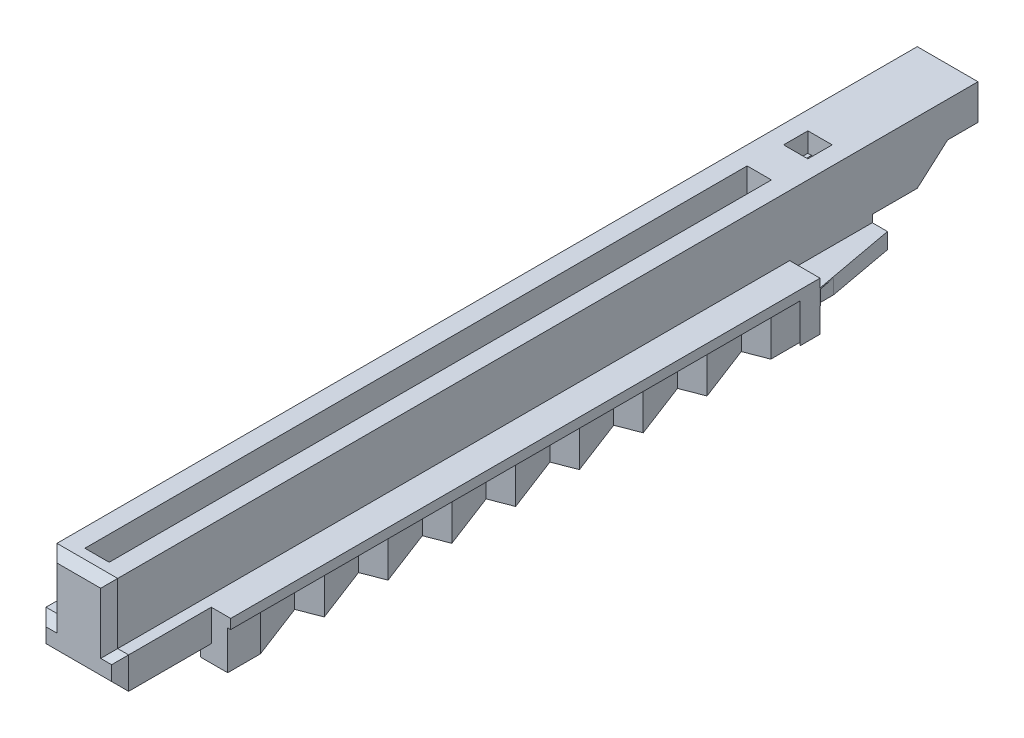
from build123d import *

# Parameters (mm, degrees)
ESQUISSE1_W              = 5
ESQUISSE1_H              = 7.6
BASE_EXTRUSION_DEPTH     = 71.5
ESQUISSE2_W              = 2
ESQUISSE2_H              = 54.5
ENL_V_MAT_EXTRU_1_DEPTH  = 4
ENL_V_MAT_EXTRU_2_DEPTH  = 73.07641778
ENL_V_MAT_EXTRU_3_DEPTH  = 6
ESQUISSE8_W              = 10
ESQUISSE8_H              = 4
BOSS_EXTRU_1_DEPTH       = 56
ESQUISSE9_W              = 5
ESQUISSE9_H              = 56
ENL_V_MAT_EXTRU_7_DEPTH  = 1.4
ENL_V_MAT_EXTRU_8_DEPTH  = 2
ESQUISSE12_W             = 1.6
ESQUISSE12_H             = 7.5
ENL_V_MAT_EXTRU_10_DEPTH = 73.453433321
ESQUISSE13_W             = 1.6
ESQUISSE13_H             = 7.3
ENL_V_MAT_EXTRU_11_DEPTH = 73.453433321
ESQUISSE14_W             = 0.9
ESQUISSE14_H             = 5
ENL_V_MAT_EXTRU_12_DEPTH = 1.4
ESQUISSE15_W             = 0.9
ESQUISSE15_H             = 7.5
ENL_V_MAT_EXTRU_13_DEPTH = 1.4
CHANFREIN1_SIZE          = 0.7
ESQUISSE16_W             = 2.5
ESQUISSE16_H             = 1.3
BOSS_EXTRU_2_DEPTH       = 6.8
ESQUISSE17_W             = 2.5
ESQUISSE17_H             = 1.3
BOSS_EXTRU_3_DEPTH       = 6.8
ENL_V_MAT_EXTRU_14_DEPTH = 73.117889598
ENL_V_MAT_EXTRU_15_DEPTH = 73.117889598
ENL_V_MAT_EXTRU_16_DEPTH = 3.2
ENL_V_MAT_EXTRU_17_DEPTH = 3.2
ESQUISSE22_W             = 2
ESQUISSE22_H             = 2
ENL_V_MAT_EXTRU_18_DEPTH = 1.6


with BuildPart() as part:
    # Esquisse1 → Base-Extrusion (new body)
    with BuildSketch(Plane.XY):
        with Locations((2.5, 3.8)):
            Rectangle(ESQUISSE1_W, ESQUISSE1_H)
    extrude(amount=BASE_EXTRUSION_DEPTH)

    # Esquisse2 → Enl_v. mat.-Extru.1 (cut)
    with BuildSketch(Plane(origin=(0, 7.6, 0), x_dir=(-1, 0, 0), z_dir=(0, 1, 0))):
        with Locations((-2.5, 42.75)):
            Rectangle(ESQUISSE2_W, ESQUISSE2_H)
    extrude(amount=-ENL_V_MAT_EXTRU_1_DEPTH, mode=Mode.SUBTRACT)

    # Esquisse3 → Enl_v. mat.-Extru.2 (cut, through all)
    with BuildSketch(Plane(origin=(5, 0, 0), x_dir=(0, 0, -1), z_dir=(1, 0, 0))):
        Polygon((0, 0), (-8.7, 0), (-8.7, 2.5), (-5, 2.5), (-2.5, 4.7), (0, 4.7), align=None)
    extrude(amount=-ENL_V_MAT_EXTRU_2_DEPTH, mode=Mode.SUBTRACT)

    # Esquisse4 → Enl_v. mat.-Extru.3 (cut)
    with BuildSketch(Plane.XZ):
        Polygon((4.5, 0), (0.5, 0), (0.5, 10.45), (1.8, 10.45), (1.8, 11.85), (0.5, 11.85), (0.5, 13.6), (4.5, 13.6), (4.5, 11.85), (3.2, 11.85), (3.2, 10.45), (4.5, 10.45), align=None)
    extrude(amount=-ENL_V_MAT_EXTRU_3_DEPTH, mode=Mode.SUBTRACT)

    # Esquisse8 → Boss.-Extru.1 (add)
    with BuildSketch(Plane.XY.offset(71.5)):
        with Locations((2.5, 0.6)):
            Rectangle(ESQUISSE8_W, ESQUISSE8_H)
    extrude(amount=-BOSS_EXTRU_1_DEPTH)

    # Esquisse9 → Enl_v. mat.-Extru.7 (cut)
    with BuildSketch(Plane.XZ.offset(1.4)):
        with Locations((2.5, 43.5)):
            Rectangle(ESQUISSE9_W, ESQUISSE9_H)
    extrude(amount=-ENL_V_MAT_EXTRU_7_DEPTH, mode=Mode.SUBTRACT)

    # Esquisse10 → Enl_v. mat.-Extru.8 (cut)
    with BuildSketch(Plane.XZ):
        with BuildLine():
            Line((3.5, 69.75), (1.5, 69.75))
            Line((1.5, 69.75), (1.5, 66.868033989))
            ThreePointArc((1.5, 66.868033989), (1, 65.75), (1.5, 64.631966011))
            Line((1.5, 64.631966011), (1.5, 43.868033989))
            ThreePointArc((1.5, 43.868033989), (1, 42.75), (1.5, 41.631966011))
            Line((1.5, 41.631966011), (1.5, 20.868033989))
            ThreePointArc((1.5, 20.868033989), (1, 19.75), (1.5, 18.631966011))
            Line((1.5, 18.631966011), (1.5, 15.75))
            Line((1.5, 15.75), (3.5, 15.75))
            Line((3.5, 15.75), (3.5, 18.631966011))
            ThreePointArc((3.5, 18.631966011), (4, 19.75), (3.5, 20.868033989))
            Line((3.5, 20.868033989), (3.5, 41.631966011))
            ThreePointArc((3.5, 41.631966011), (4, 42.75), (3.5, 43.868033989))
            Line((3.5, 43.868033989), (3.5, 64.631966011))
            ThreePointArc((3.5, 64.631966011), (4, 65.75), (3.5, 66.868033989))
            Line((3.5, 66.868033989), (3.5, 69.75))
        make_face()
    extrude(amount=-ENL_V_MAT_EXTRU_8_DEPTH, mode=Mode.SUBTRACT)

    # Esquisse12 → Enl_v. mat.-Extru.10 (cut, through all)
    with BuildSketch(Plane.XZ.offset(1.4)):
        with Locations((6.7, 67.75)):
            Rectangle(ESQUISSE12_W, ESQUISSE12_H)
    extrude(amount=-ENL_V_MAT_EXTRU_10_DEPTH, mode=Mode.SUBTRACT)

    # Esquisse13 → Enl_v. mat.-Extru.11 (cut, through all)
    with BuildSketch(Plane.XZ.offset(1.4)):
        with Locations((-1.7, 67.85)):
            Rectangle(ESQUISSE13_W, ESQUISSE13_H)
    extrude(amount=-ENL_V_MAT_EXTRU_11_DEPTH, mode=Mode.SUBTRACT)

    # Esquisse14 → Enl_v. mat.-Extru.12 (cut)
    with BuildSketch(Plane.XZ.offset(1.4)):
        with Locations((-0.45, 69)):
            Rectangle(ESQUISSE14_W, ESQUISSE14_H)
    extrude(amount=-ENL_V_MAT_EXTRU_12_DEPTH, mode=Mode.SUBTRACT)

    # Esquisse15 → Enl_v. mat.-Extru.13 (cut)
    with BuildSketch(Plane.XZ.offset(1.4)):
        with Locations((5.45, 67.75)):
            Rectangle(ESQUISSE15_W, ESQUISSE15_H)
    extrude(amount=-ENL_V_MAT_EXTRU_13_DEPTH, mode=Mode.SUBTRACT)

    # Chanfrein1
    chanfrein1_edges = [part.edges().sort_by_distance(p)[0] for p in [
        (2.5, 0, 71.5),
        (5.45, 2.6, 71.5),
        (5.9, 1.3, 71.5),
        (5, 5.1, 71.5),
        (2.5, 7.6, 71.5),
        (0, 5.1, 71.5),
        (-0.45, 2.6, 71.5),
        (-0.9, 1.3, 71.5),
    ]]
    chamfer(chanfrein1_edges, length=CHANFREIN1_SIZE)

    # Esquisse16 → Boss.-Extru.2 (add)
    with BuildSketch(Plane(origin=(0, 0, 15.5), x_dir=(-1, 0, 0), z_dir=(0, 0, -1))):
        with Locations((1.25, 1.25)):
            Rectangle(ESQUISSE16_W, ESQUISSE16_H)
    extrude(amount=BOSS_EXTRU_2_DEPTH)

    # Esquisse17 → Boss.-Extru.3 (add)
    with BuildSketch(Plane(origin=(0, 0, 15.5), x_dir=(-1, 0, 0), z_dir=(0, 0, -1))):
        with Locations((-6.25, 1.25)):
            Rectangle(ESQUISSE17_W, ESQUISSE17_H)
    extrude(amount=BOSS_EXTRU_3_DEPTH)

    # Esquisse18 → Enl_v. mat.-Extru.14 (cut, through all)
    with BuildSketch(Plane(origin=(0, 1.9, 0), x_dir=(-1, 0, 0), z_dir=(0, 1, 0))):
        Polygon((-7.5, 15.5), (-6.25, 8.7), (-9, 8), (-9, 15), align=None)
    extrude(amount=-ENL_V_MAT_EXTRU_14_DEPTH, mode=Mode.SUBTRACT)

    # Esquisse19 → Enl_v. mat.-Extru.15 (cut, through all)
    with BuildSketch(Plane(origin=(0, 1.9, 0), x_dir=(-1, 0, 0), z_dir=(0, 1, 0))):
        Polygon((2.5, 15.5), (1.25, 8.7), (4.000200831, 8.194448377), (4.15380408, 14.281216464), align=None)
    extrude(amount=-ENL_V_MAT_EXTRU_15_DEPTH, mode=Mode.SUBTRACT)

    # Esquisse20 → Enl_v. mat.-Extru.16 (cut)
    with BuildSketch(Plane.XZ.offset(1.4)):
        Polygon((7.25, 56.05), (7.25, 61.3), (5.493532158, 56.724244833), align=None)
        Polygon((7.25, 64), (7.25, 61.3), (7.25, 56.05), (7.25, 50.8), (7.25, 45.55), (7.25, 40.3), (7.25, 35.05), (7.25, 29.8), (7.25, 24.55), (7.25, 19.3), (7.25, 14.14), (7.489564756, 15.443232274), (7.5, 17.134095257), (7.5, 19.384218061), (7.5, 21.230731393), (7.5, 23.18823733), (7.5, 25.377818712), (7.5, 27.658212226), (7.5, 29.898244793), (7.5, 32.249269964), (7.5, 34.479212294), (7.5, 36.709154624), (7.5, 39.039999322), (7.5, 41.249761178), (7.5, 43.520064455), (7.5, 45.820638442), (7.5, 48.292746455), (7.5, 50.8), (7.5, 53.105789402), (7.5, 55.507265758), (7.5, 57.626215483), (7.5, 58.150907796), (7.5, 64), align=None)
        Polygon((7.25, 50.8), (7.25, 56.05), (5.493532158, 51.474244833), align=None)
        Polygon((7.25, 45.55), (7.25, 50.8), (5.493532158, 46.224244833), align=None)
        Polygon((7.25, 40.3), (7.25, 45.55), (5.493532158, 40.974244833), align=None)
        Polygon((7.25, 35.05), (7.25, 40.3), (5.493532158, 35.724244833), align=None)
        Polygon((7.25, 29.8), (7.25, 35.05), (5.493532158, 30.474244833), align=None)
        Polygon((7.25, 24.55), (7.25, 29.8), (5.493532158, 25.224244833), align=None)
        Polygon((7.25, 19.3), (7.25, 24.55), (5.493532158, 19.974244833), align=None)
    extrude(amount=-ENL_V_MAT_EXTRU_16_DEPTH, mode=Mode.SUBTRACT)

    # Esquisse21 → Enl_v. mat.-Extru.17 (cut)
    with BuildSketch(Plane.XZ.offset(1.4)):
        Polygon((-2.25, 58.15), (-0.5, 62.73155948), (-2.25, 63.4), (-2.25, 64.2), (-2.5, 64.2), (-2.5, 45.247174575), (-2.5, 15.5), (-2.25, 14.282339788), (-2.25, 21.4), (-2.25, 26.65), (-2.25, 31.9), (-0.5, 36.48155948), (-2.25, 37.15), (-0.5, 41.73155948), (-2.25, 42.4), (-0.5, 46.98155948), (-2.25, 47.65), (-0.5, 52.23155948), (-2.25, 52.9), (-0.5, 57.48155948), align=None)
        Polygon((-2.25, 26.65), (-2.25, 21.4), (-0.5, 25.98155948), align=None)
        Polygon((-2.25, 31.9), (-2.25, 26.65), (-0.5, 31.23155948), align=None)
    extrude(amount=-ENL_V_MAT_EXTRU_17_DEPTH, mode=Mode.SUBTRACT)

    # Esquisse22 → Enl_v. mat.-Extru.18 (cut)
    with BuildSketch(Plane(origin=(0, 7.6, 0), x_dir=(-1, 0, 0), z_dir=(0, 1, 0))):
        with Locations((-2.5, 11.5)):
            Rectangle(ESQUISSE22_W, ESQUISSE22_H)
    extrude(amount=-ENL_V_MAT_EXTRU_18_DEPTH, mode=Mode.SUBTRACT)


solid = part.part
